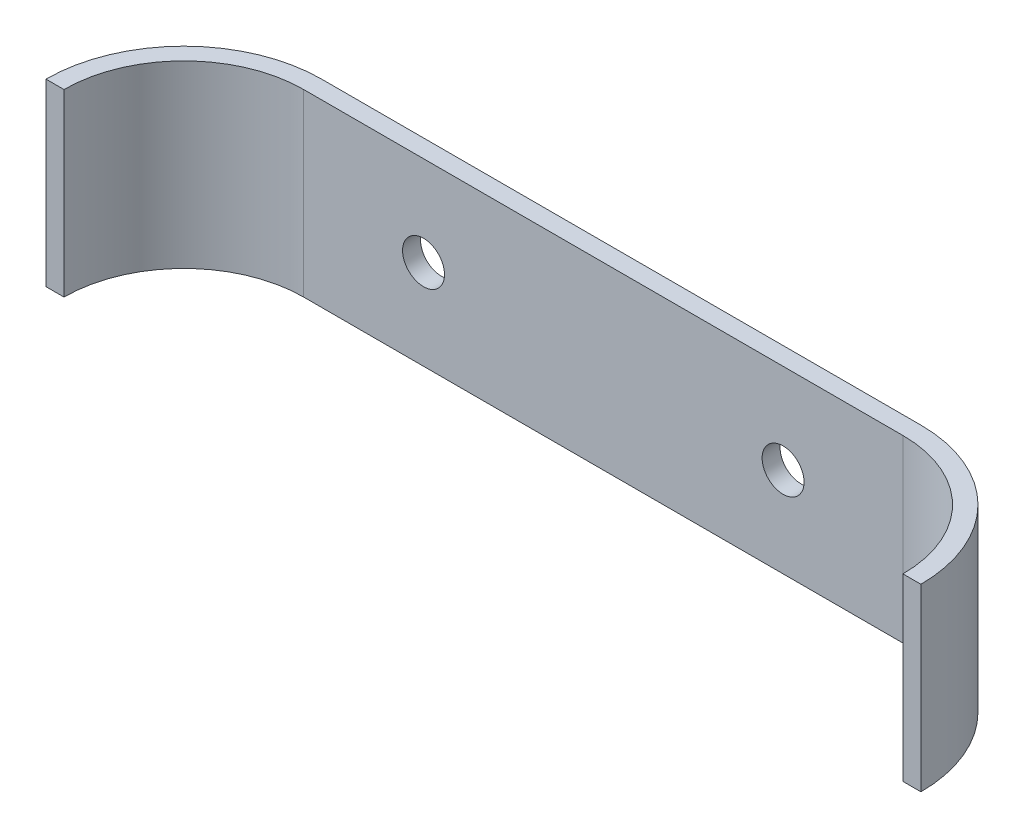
from build123d import *

# Parameters (mm, degrees)
EXTRUDE1_DEPTH = 15
SKETCH2_R      = 1.75
EXTRUDE2_DEPTH = 65.087830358


with BuildPart() as part:
    # Sketch1 → Extrude1 (new body)
    with BuildSketch(Plane(origin=(0, 0, 0), x_dir=(1, 0, 0), z_dir=(0, 1, 0))):
        with BuildLine():
            Line((0, 10), (50, 10))
            ThreePointArc((50, 10), (57.071067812, 7.071067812), (60, 0))
            Line((60, 0), (61.5, 0))
            ThreePointArc((61.5, 0), (58.131727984, 8.131727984), (50, 11.5))
            Line((50, 11.5), (0, 11.5))
            ThreePointArc((0, 11.5), (-8.131727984, 8.131727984), (-11.5, 0))
            Line((-11.5, 0), (-10, 0))
            ThreePointArc((-10, 0), (-7.071067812, 7.071067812), (0, 10))
        make_face()
    extrude(amount=EXTRUDE1_DEPTH)

    # Sketch2 → Extrude2 (cut, through all)
    with BuildSketch(Plane.XY.offset(-10)):
        with Locations((10, 7.5)):
            Circle(SKETCH2_R)
        with Locations((40, 7.5)):
            Circle(SKETCH2_R)
    extrude(amount=-EXTRUDE2_DEPTH, mode=Mode.SUBTRACT)


solid = part.part
